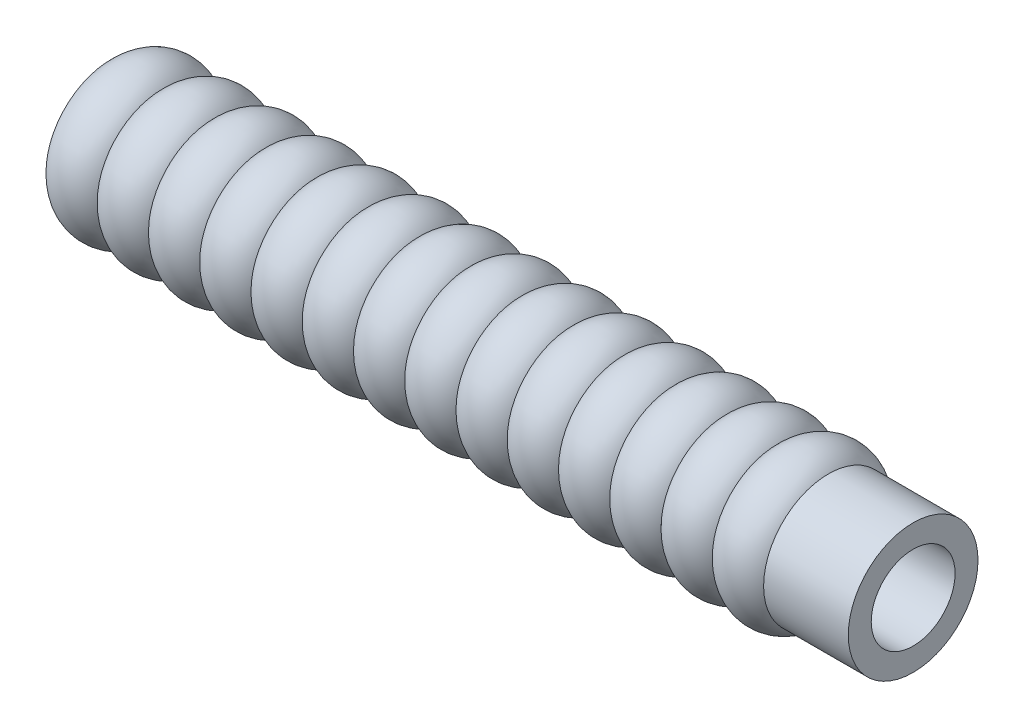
ISO-10303-21;
HEADER;
FILE_DESCRIPTION(('STEP AP214'),'2;1');
FILE_NAME('part.step','',(''),(''),'','','');
FILE_SCHEMA(('AUTOMOTIVE_DESIGN { 1 0 10303 214 1 1 1 1 }'));
ENDSEC;
DATA;
#1=APPLICATION_CONTEXT('core data for automotive mechanical design processes');
#2=APPLICATION_PROTOCOL_DEFINITION('international standard','automotive_design',2000,#1);
#3=PRODUCT_CONTEXT('',#1,'mechanical');
#4=PRODUCT('Part','Part','',(#3));
#5=PRODUCT_RELATED_PRODUCT_CATEGORY('part','',(#4));
#6=PRODUCT_DEFINITION_FORMATION('','',#4);
#7=PRODUCT_DEFINITION_CONTEXT('part definition',#1,'design');
#8=PRODUCT_DEFINITION('design','',#6,#7);
#9=PRODUCT_DEFINITION_SHAPE('','',#8);
#10=(LENGTH_UNIT() NAMED_UNIT(*) SI_UNIT(.MILLI.,.METRE.));
#11=(NAMED_UNIT(*) PLANE_ANGLE_UNIT() SI_UNIT($,.RADIAN.));
#12=(NAMED_UNIT(*) SI_UNIT($,.STERADIAN.) SOLID_ANGLE_UNIT());
#13=UNCERTAINTY_MEASURE_WITH_UNIT(LENGTH_MEASURE(1.E-05),#10,'distance_accuracy_value','');
#14=(GEOMETRIC_REPRESENTATION_CONTEXT(3) GLOBAL_UNCERTAINTY_ASSIGNED_CONTEXT((#13)) GLOBAL_UNIT_ASSIGNED_CONTEXT((#10,
#11,#12)) REPRESENTATION_CONTEXT('',''));
#15=CARTESIAN_POINT('',(0.,0.,0.));
#16=DIRECTION('',(0.,0.,1.));
#17=DIRECTION('',(1.,0.,0.));
#18=AXIS2_PLACEMENT_3D('',#15,#16,#17);
#19=CARTESIAN_POINT('',(21.0247582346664,0.,0.));
#20=DIRECTION('',(-1.,0.,0.));
#21=DIRECTION('',(0.,0.,1.));
#22=AXIS2_PLACEMENT_3D('',#19,#20,#21);
#23=CYLINDRICAL_SURFACE('',#22,3.65813100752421);
#24=CARTESIAN_POINT('',(112.609903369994,0.,0.));
#25=DIRECTION('',(-1.,0.,0.));
#26=DIRECTION('',(0.,0.,1.));
#27=AXIS2_PLACEMENT_3D('',#24,#25,#26);
#28=CIRCLE('',#27,3.65813100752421);
#29=CARTESIAN_POINT('',(112.609903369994,0.,3.65813100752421));
#30=VERTEX_POINT('',#29);
#31=EDGE_CURVE('E122',#30,#30,#28,.T.);
#32=ORIENTED_EDGE('',*,*,#31,.T.);
#33=EDGE_LOOP('',(#32));
#34=FACE_BOUND('',#33,.T.);
#35=CARTESIAN_POINT('',(120.,0.,0.));
#36=DIRECTION('',(1.,0.,0.));
#37=DIRECTION('',(0.,0.,-1.));
#38=AXIS2_PLACEMENT_3D('',#35,#36,#37);
#39=CIRCLE('',#38,3.65813100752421);
#40=CARTESIAN_POINT('',(120.,0.,-3.65813100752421));
#41=VERTEX_POINT('',#40);
#42=EDGE_CURVE('E11',#41,#41,#39,.F.);
#43=ORIENTED_EDGE('',*,*,#42,.F.);
#44=EDGE_LOOP('',(#43));
#45=FACE_BOUND('',#44,.T.);
#46=ADVANCED_FACE('F42',(#34,#45),#23,.F.);
#47=CARTESIAN_POINT('',(21.0247582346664,0.,0.));
#48=DIRECTION('',(-1.,0.,0.));
#49=DIRECTION('',(0.,0.,1.));
#50=AXIS2_PLACEMENT_3D('',#47,#48,#49);
#51=CYLINDRICAL_SURFACE('',#50,5.65813100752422);
#52=CARTESIAN_POINT('',(112.609903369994,0.,0.));
#53=DIRECTION('',(-1.,0.,0.));
#54=DIRECTION('',(0.,0.,1.));
#55=AXIS2_PLACEMENT_3D('',#52,#53,#54);
#56=CIRCLE('',#55,5.65813100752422);
#57=CARTESIAN_POINT('',(112.609903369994,0.,5.65813100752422));
#58=VERTEX_POINT('',#57);
#59=EDGE_CURVE('E118',#58,#58,#56,.T.);
#60=ORIENTED_EDGE('',*,*,#59,.F.);
#61=EDGE_LOOP('',(#60));
#62=FACE_BOUND('',#61,.T.);
#63=CARTESIAN_POINT('',(120.,0.,0.));
#64=DIRECTION('',(1.,0.,0.));
#65=DIRECTION('',(0.,0.,-1.));
#66=AXIS2_PLACEMENT_3D('',#63,#64,#65);
#67=CIRCLE('',#66,5.65813100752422);
#68=CARTESIAN_POINT('',(120.,0.,-5.65813100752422));
#69=VERTEX_POINT('',#68);
#70=EDGE_CURVE('E46',#69,#69,#67,.T.);
#71=ORIENTED_EDGE('',*,*,#70,.F.);
#72=EDGE_LOOP('',(#71));
#73=FACE_BOUND('',#72,.T.);
#74=ADVANCED_FACE('F181',(#62,#73),#51,.T.);
#75=CARTESIAN_POINT('',(52.2360679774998,0.,0.));
#76=DIRECTION('',(-1.,0.,0.));
#77=DIRECTION('',(0.,0.,1.));
#78=AXIS2_PLACEMENT_3D('',#75,#76,#77);
#79=TOROIDAL_SURFACE('',#78,5.65813100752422,3.);
#80=CARTESIAN_POINT('',(54.4721359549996,0.,0.));
#81=DIRECTION('',(-1.,0.,0.));
#82=DIRECTION('',(0.,0.,1.));
#83=AXIS2_PLACEMENT_3D('',#80,#81,#82);
#84=CIRCLE('',#83,3.65813100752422);
#85=CARTESIAN_POINT('',(54.4721359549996,0.,3.65813100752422));
#86=VERTEX_POINT('',#85);
#87=EDGE_CURVE('E56',#86,#86,#84,.T.);
#88=ORIENTED_EDGE('',*,*,#87,.F.);
#89=EDGE_LOOP('',(#88));
#90=FACE_BOUND('',#89,.T.);
#91=CARTESIAN_POINT('',(50.,0.,0.));
#92=DIRECTION('',(-1.,0.,0.));
#93=DIRECTION('',(0.,0.,1.));
#94=AXIS2_PLACEMENT_3D('',#91,#92,#93);
#95=CIRCLE('',#94,3.65813100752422);
#96=CARTESIAN_POINT('',(50.,0.,3.65813100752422));
#97=VERTEX_POINT('',#96);
#98=EDGE_CURVE('E58',#97,#97,#95,.T.);
#99=ORIENTED_EDGE('',*,*,#98,.T.);
#100=EDGE_LOOP('',(#99));
#101=FACE_BOUND('',#100,.T.);
#102=ADVANCED_FACE('F44',(#90,#101),#79,.T.);
#103=CARTESIAN_POINT('',(56.7082039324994,0.,0.));
#104=DIRECTION('',(-1.,0.,0.));
#105=DIRECTION('',(0.,0.,1.));
#106=AXIS2_PLACEMENT_3D('',#103,#104,#105);
#107=TOROIDAL_SURFACE('',#106,5.65813100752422,3.);
#108=CARTESIAN_POINT('',(58.9442719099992,0.,0.));
#109=DIRECTION('',(-1.,0.,0.));
#110=DIRECTION('',(0.,0.,1.));
#111=AXIS2_PLACEMENT_3D('',#108,#109,#110);
#112=CIRCLE('',#111,3.65813100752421);
#113=CARTESIAN_POINT('',(58.9442719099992,0.,3.65813100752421));
#114=VERTEX_POINT('',#113);
#115=EDGE_CURVE('E170',#114,#114,#112,.T.);
#116=ORIENTED_EDGE('',*,*,#115,.F.);
#117=EDGE_LOOP('',(#116));
#118=FACE_BOUND('',#117,.T.);
#119=ORIENTED_EDGE('',*,*,#87,.T.);
#120=EDGE_LOOP('',(#119));
#121=FACE_BOUND('',#120,.T.);
#122=ADVANCED_FACE('F177',(#118,#121),#107,.T.);
#123=CARTESIAN_POINT('',(61.180339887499,0.,0.));
#124=DIRECTION('',(-1.,0.,0.));
#125=DIRECTION('',(0.,0.,1.));
#126=AXIS2_PLACEMENT_3D('',#123,#124,#125);
#127=TOROIDAL_SURFACE('',#126,5.65813100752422,3.);
#128=CARTESIAN_POINT('',(63.4164078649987,0.,0.));
#129=DIRECTION('',(-1.,0.,0.));
#130=DIRECTION('',(0.,0.,1.));
#131=AXIS2_PLACEMENT_3D('',#128,#129,#130);
#132=CIRCLE('',#131,3.65813100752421);
#133=CARTESIAN_POINT('',(63.4164078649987,0.,3.65813100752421));
#134=VERTEX_POINT('',#133);
#135=EDGE_CURVE('E166',#134,#134,#132,.T.);
#136=ORIENTED_EDGE('',*,*,#135,.F.);
#137=EDGE_LOOP('',(#136));
#138=FACE_BOUND('',#137,.T.);
#139=ORIENTED_EDGE('',*,*,#115,.T.);
#140=EDGE_LOOP('',(#139));
#141=FACE_BOUND('',#140,.T.);
#142=ADVANCED_FACE('F255',(#138,#141),#127,.T.);
#143=CARTESIAN_POINT('',(65.6524758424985,0.,0.));
#144=DIRECTION('',(-1.,0.,0.));
#145=DIRECTION('',(0.,0.,1.));
#146=AXIS2_PLACEMENT_3D('',#143,#144,#145);
#147=TOROIDAL_SURFACE('',#146,5.65813100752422,3.);
#148=CARTESIAN_POINT('',(67.8885438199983,0.,0.));
#149=DIRECTION('',(-1.,0.,0.));
#150=DIRECTION('',(0.,0.,1.));
#151=AXIS2_PLACEMENT_3D('',#148,#149,#150);
#152=CIRCLE('',#151,3.65813100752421);
#153=CARTESIAN_POINT('',(67.8885438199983,0.,3.65813100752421));
#154=VERTEX_POINT('',#153);
#155=EDGE_CURVE('E162',#154,#154,#152,.T.);
#156=ORIENTED_EDGE('',*,*,#155,.F.);
#157=EDGE_LOOP('',(#156));
#158=FACE_BOUND('',#157,.T.);
#159=ORIENTED_EDGE('',*,*,#135,.T.);
#160=EDGE_LOOP('',(#159));
#161=FACE_BOUND('',#160,.T.);
#162=ADVANCED_FACE('F251',(#158,#161),#147,.T.);
#163=CARTESIAN_POINT('',(70.1246117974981,0.,0.));
#164=DIRECTION('',(-1.,0.,0.));
#165=DIRECTION('',(0.,0.,1.));
#166=AXIS2_PLACEMENT_3D('',#163,#164,#165);
#167=TOROIDAL_SURFACE('',#166,5.65813100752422,3.);
#168=CARTESIAN_POINT('',(72.3606797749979,0.,0.));
#169=DIRECTION('',(-1.,0.,0.));
#170=DIRECTION('',(0.,0.,1.));
#171=AXIS2_PLACEMENT_3D('',#168,#169,#170);
#172=CIRCLE('',#171,3.65813100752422);
#173=CARTESIAN_POINT('',(72.3606797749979,0.,3.65813100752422));
#174=VERTEX_POINT('',#173);
#175=EDGE_CURVE('E158',#174,#174,#172,.T.);
#176=ORIENTED_EDGE('',*,*,#175,.F.);
#177=EDGE_LOOP('',(#176));
#178=FACE_BOUND('',#177,.T.);
#179=ORIENTED_EDGE('',*,*,#155,.T.);
#180=EDGE_LOOP('',(#179));
#181=FACE_BOUND('',#180,.T.);
#182=ADVANCED_FACE('F247',(#178,#181),#167,.T.);
#183=CARTESIAN_POINT('',(74.5967477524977,0.,0.));
#184=DIRECTION('',(-1.,0.,0.));
#185=DIRECTION('',(0.,0.,1.));
#186=AXIS2_PLACEMENT_3D('',#183,#184,#185);
#187=TOROIDAL_SURFACE('',#186,5.65813100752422,3.);
#188=CARTESIAN_POINT('',(76.8328157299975,0.,0.));
#189=DIRECTION('',(-1.,0.,0.));
#190=DIRECTION('',(0.,0.,1.));
#191=AXIS2_PLACEMENT_3D('',#188,#189,#190);
#192=CIRCLE('',#191,3.65813100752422);
#193=CARTESIAN_POINT('',(76.8328157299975,0.,3.65813100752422));
#194=VERTEX_POINT('',#193);
#195=EDGE_CURVE('E154',#194,#194,#192,.T.);
#196=ORIENTED_EDGE('',*,*,#195,.F.);
#197=EDGE_LOOP('',(#196));
#198=FACE_BOUND('',#197,.T.);
#199=ORIENTED_EDGE('',*,*,#175,.T.);
#200=EDGE_LOOP('',(#199));
#201=FACE_BOUND('',#200,.T.);
#202=ADVANCED_FACE('F243',(#198,#201),#187,.T.);
#203=CARTESIAN_POINT('',(79.0688837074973,0.,0.));
#204=DIRECTION('',(-1.,0.,0.));
#205=DIRECTION('',(0.,0.,1.));
#206=AXIS2_PLACEMENT_3D('',#203,#204,#205);
#207=TOROIDAL_SURFACE('',#206,5.65813100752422,3.);
#208=CARTESIAN_POINT('',(81.3049516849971,0.,0.));
#209=DIRECTION('',(-1.,0.,0.));
#210=DIRECTION('',(0.,0.,1.));
#211=AXIS2_PLACEMENT_3D('',#208,#209,#210);
#212=CIRCLE('',#211,3.65813100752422);
#213=CARTESIAN_POINT('',(81.3049516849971,0.,3.65813100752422));
#214=VERTEX_POINT('',#213);
#215=EDGE_CURVE('E150',#214,#214,#212,.T.);
#216=ORIENTED_EDGE('',*,*,#215,.F.);
#217=EDGE_LOOP('',(#216));
#218=FACE_BOUND('',#217,.T.);
#219=ORIENTED_EDGE('',*,*,#195,.T.);
#220=EDGE_LOOP('',(#219));
#221=FACE_BOUND('',#220,.T.);
#222=ADVANCED_FACE('F239',(#218,#221),#207,.T.);
#223=CARTESIAN_POINT('',(83.5410196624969,0.,0.));
#224=DIRECTION('',(-1.,0.,0.));
#225=DIRECTION('',(0.,0.,1.));
#226=AXIS2_PLACEMENT_3D('',#223,#224,#225);
#227=TOROIDAL_SURFACE('',#226,5.65813100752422,3.);
#228=CARTESIAN_POINT('',(85.7770876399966,0.,0.));
#229=DIRECTION('',(-1.,0.,0.));
#230=DIRECTION('',(0.,0.,1.));
#231=AXIS2_PLACEMENT_3D('',#228,#229,#230);
#232=CIRCLE('',#231,3.65813100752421);
#233=CARTESIAN_POINT('',(85.7770876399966,0.,3.65813100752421));
#234=VERTEX_POINT('',#233);
#235=EDGE_CURVE('E146',#234,#234,#232,.T.);
#236=ORIENTED_EDGE('',*,*,#235,.F.);
#237=EDGE_LOOP('',(#236));
#238=FACE_BOUND('',#237,.T.);
#239=ORIENTED_EDGE('',*,*,#215,.T.);
#240=EDGE_LOOP('',(#239));
#241=FACE_BOUND('',#240,.T.);
#242=ADVANCED_FACE('F235',(#238,#241),#227,.T.);
#243=CARTESIAN_POINT('',(88.0131556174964,0.,0.));
#244=DIRECTION('',(-1.,0.,0.));
#245=DIRECTION('',(0.,0.,1.));
#246=AXIS2_PLACEMENT_3D('',#243,#244,#245);
#247=TOROIDAL_SURFACE('',#246,5.65813100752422,3.);
#248=CARTESIAN_POINT('',(90.2492235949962,0.,0.));
#249=DIRECTION('',(-1.,0.,0.));
#250=DIRECTION('',(0.,0.,1.));
#251=AXIS2_PLACEMENT_3D('',#248,#249,#250);
#252=CIRCLE('',#251,3.65813100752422);
#253=CARTESIAN_POINT('',(90.2492235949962,0.,3.65813100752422));
#254=VERTEX_POINT('',#253);
#255=EDGE_CURVE('E142',#254,#254,#252,.T.);
#256=ORIENTED_EDGE('',*,*,#255,.F.);
#257=EDGE_LOOP('',(#256));
#258=FACE_BOUND('',#257,.T.);
#259=ORIENTED_EDGE('',*,*,#235,.T.);
#260=EDGE_LOOP('',(#259));
#261=FACE_BOUND('',#260,.T.);
#262=ADVANCED_FACE('F231',(#258,#261),#247,.T.);
#263=CARTESIAN_POINT('',(92.485291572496,0.,0.));
#264=DIRECTION('',(-1.,0.,0.));
#265=DIRECTION('',(0.,0.,1.));
#266=AXIS2_PLACEMENT_3D('',#263,#264,#265);
#267=TOROIDAL_SURFACE('',#266,5.65813100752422,3.);
#268=CARTESIAN_POINT('',(94.7213595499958,0.,0.));
#269=DIRECTION('',(-1.,0.,0.));
#270=DIRECTION('',(0.,0.,1.));
#271=AXIS2_PLACEMENT_3D('',#268,#269,#270);
#272=CIRCLE('',#271,3.65813100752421);
#273=CARTESIAN_POINT('',(94.7213595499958,0.,3.65813100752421));
#274=VERTEX_POINT('',#273);
#275=EDGE_CURVE('E138',#274,#274,#272,.T.);
#276=ORIENTED_EDGE('',*,*,#275,.F.);
#277=EDGE_LOOP('',(#276));
#278=FACE_BOUND('',#277,.T.);
#279=ORIENTED_EDGE('',*,*,#255,.T.);
#280=EDGE_LOOP('',(#279));
#281=FACE_BOUND('',#280,.T.);
#282=ADVANCED_FACE('F227',(#278,#281),#267,.T.);
#283=CARTESIAN_POINT('',(96.9574275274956,0.,0.));
#284=DIRECTION('',(-1.,0.,0.));
#285=DIRECTION('',(0.,0.,1.));
#286=AXIS2_PLACEMENT_3D('',#283,#284,#285);
#287=TOROIDAL_SURFACE('',#286,5.65813100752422,3.);
#288=CARTESIAN_POINT('',(99.1934955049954,0.,0.));
#289=DIRECTION('',(-1.,0.,0.));
#290=DIRECTION('',(0.,0.,1.));
#291=AXIS2_PLACEMENT_3D('',#288,#289,#290);
#292=CIRCLE('',#291,3.65813100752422);
#293=CARTESIAN_POINT('',(99.1934955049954,0.,3.65813100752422));
#294=VERTEX_POINT('',#293);
#295=EDGE_CURVE('E134',#294,#294,#292,.T.);
#296=ORIENTED_EDGE('',*,*,#295,.F.);
#297=EDGE_LOOP('',(#296));
#298=FACE_BOUND('',#297,.T.);
#299=ORIENTED_EDGE('',*,*,#275,.T.);
#300=EDGE_LOOP('',(#299));
#301=FACE_BOUND('',#300,.T.);
#302=ADVANCED_FACE('F223',(#298,#301),#287,.T.);
#303=CARTESIAN_POINT('',(101.429563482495,0.,0.));
#304=DIRECTION('',(-1.,0.,0.));
#305=DIRECTION('',(0.,0.,1.));
#306=AXIS2_PLACEMENT_3D('',#303,#304,#305);
#307=TOROIDAL_SURFACE('',#306,5.65813100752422,2.99999999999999);
#308=CARTESIAN_POINT('',(103.665631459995,0.,0.));
#309=DIRECTION('',(-1.,0.,0.));
#310=DIRECTION('',(0.,0.,1.));
#311=AXIS2_PLACEMENT_3D('',#308,#309,#310);
#312=CIRCLE('',#311,3.65813100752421);
#313=CARTESIAN_POINT('',(103.665631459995,0.,3.65813100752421));
#314=VERTEX_POINT('',#313);
#315=EDGE_CURVE('E130',#314,#314,#312,.T.);
#316=ORIENTED_EDGE('',*,*,#315,.F.);
#317=EDGE_LOOP('',(#316));
#318=FACE_BOUND('',#317,.T.);
#319=ORIENTED_EDGE('',*,*,#295,.T.);
#320=EDGE_LOOP('',(#319));
#321=FACE_BOUND('',#320,.T.);
#322=ADVANCED_FACE('F219',(#318,#321),#307,.T.);
#323=CARTESIAN_POINT('',(105.901699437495,0.,0.));
#324=DIRECTION('',(-1.,0.,0.));
#325=DIRECTION('',(0.,0.,1.));
#326=AXIS2_PLACEMENT_3D('',#323,#324,#325);
#327=TOROIDAL_SURFACE('',#326,5.65813100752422,3.);
#328=CARTESIAN_POINT('',(108.137767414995,0.,0.));
#329=DIRECTION('',(-1.,0.,0.));
#330=DIRECTION('',(0.,0.,1.));
#331=AXIS2_PLACEMENT_3D('',#328,#329,#330);
#332=CIRCLE('',#331,3.65813100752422);
#333=CARTESIAN_POINT('',(108.137767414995,0.,3.65813100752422));
#334=VERTEX_POINT('',#333);
#335=EDGE_CURVE('E126',#334,#334,#332,.T.);
#336=ORIENTED_EDGE('',*,*,#335,.F.);
#337=EDGE_LOOP('',(#336));
#338=FACE_BOUND('',#337,.T.);
#339=ORIENTED_EDGE('',*,*,#315,.T.);
#340=EDGE_LOOP('',(#339));
#341=FACE_BOUND('',#340,.T.);
#342=ADVANCED_FACE('F215',(#338,#341),#327,.T.);
#343=CARTESIAN_POINT('',(110.373835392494,0.,0.));
#344=DIRECTION('',(-1.,0.,0.));
#345=DIRECTION('',(0.,0.,1.));
#346=AXIS2_PLACEMENT_3D('',#343,#344,#345);
#347=TOROIDAL_SURFACE('',#346,5.65813100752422,3.);
#348=ORIENTED_EDGE('',*,*,#31,.F.);
#349=EDGE_LOOP('',(#348));
#350=FACE_BOUND('',#349,.T.);
#351=ORIENTED_EDGE('',*,*,#335,.T.);
#352=EDGE_LOOP('',(#351));
#353=FACE_BOUND('',#352,.T.);
#354=ADVANCED_FACE('F211',(#350,#353),#347,.T.);
#355=CARTESIAN_POINT('',(110.373835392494,0.,0.));
#356=DIRECTION('',(-1.,0.,0.));
#357=DIRECTION('',(0.,0.,1.));
#358=AXIS2_PLACEMENT_3D('',#355,#356,#357);
#359=TOROIDAL_SURFACE('',#358,3.65813100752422,3.);
#360=CARTESIAN_POINT('',(108.137767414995,0.,0.));
#361=DIRECTION('',(-1.,0.,0.));
#362=DIRECTION('',(0.,0.,1.));
#363=AXIS2_PLACEMENT_3D('',#360,#361,#362);
#364=CIRCLE('',#363,5.65813100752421);
#365=CARTESIAN_POINT('',(108.137767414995,0.,5.65813100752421));
#366=VERTEX_POINT('',#365);
#367=EDGE_CURVE('E114',#366,#366,#364,.T.);
#368=ORIENTED_EDGE('',*,*,#367,.F.);
#369=EDGE_LOOP('',(#368));
#370=FACE_BOUND('',#369,.T.);
#371=ORIENTED_EDGE('',*,*,#59,.T.);
#372=EDGE_LOOP('',(#371));
#373=FACE_BOUND('',#372,.T.);
#374=ADVANCED_FACE('F214',(#370,#373),#359,.T.);
#375=CARTESIAN_POINT('',(105.901699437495,0.,0.));
#376=DIRECTION('',(-1.,0.,0.));
#377=DIRECTION('',(0.,0.,1.));
#378=AXIS2_PLACEMENT_3D('',#375,#376,#377);
#379=TOROIDAL_SURFACE('',#378,3.65813100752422,3.);
#380=CARTESIAN_POINT('',(103.665631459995,0.,0.));
#381=DIRECTION('',(-1.,0.,0.));
#382=DIRECTION('',(0.,0.,1.));
#383=AXIS2_PLACEMENT_3D('',#380,#381,#382);
#384=CIRCLE('',#383,5.65813100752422);
#385=CARTESIAN_POINT('',(103.665631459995,0.,5.65813100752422));
#386=VERTEX_POINT('',#385);
#387=EDGE_CURVE('E110',#386,#386,#384,.T.);
#388=ORIENTED_EDGE('',*,*,#387,.F.);
#389=EDGE_LOOP('',(#388));
#390=FACE_BOUND('',#389,.T.);
#391=ORIENTED_EDGE('',*,*,#367,.T.);
#392=EDGE_LOOP('',(#391));
#393=FACE_BOUND('',#392,.T.);
#394=ADVANCED_FACE('F321',(#390,#393),#379,.T.);
#395=CARTESIAN_POINT('',(101.429563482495,0.,0.));
#396=DIRECTION('',(-1.,0.,0.));
#397=DIRECTION('',(0.,0.,1.));
#398=AXIS2_PLACEMENT_3D('',#395,#396,#397);
#399=TOROIDAL_SURFACE('',#398,3.65813100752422,3.00000000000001);
#400=CARTESIAN_POINT('',(99.1934955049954,0.,0.));
#401=DIRECTION('',(-1.,0.,0.));
#402=DIRECTION('',(0.,0.,1.));
#403=AXIS2_PLACEMENT_3D('',#400,#401,#402);
#404=CIRCLE('',#403,5.65813100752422);
#405=CARTESIAN_POINT('',(99.1934955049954,0.,5.65813100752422));
#406=VERTEX_POINT('',#405);
#407=EDGE_CURVE('E106',#406,#406,#404,.T.);
#408=ORIENTED_EDGE('',*,*,#407,.F.);
#409=EDGE_LOOP('',(#408));
#410=FACE_BOUND('',#409,.T.);
#411=ORIENTED_EDGE('',*,*,#387,.T.);
#412=EDGE_LOOP('',(#411));
#413=FACE_BOUND('',#412,.T.);
#414=ADVANCED_FACE('F328',(#410,#413),#399,.T.);
#415=CARTESIAN_POINT('',(96.9574275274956,0.,0.));
#416=DIRECTION('',(-1.,0.,0.));
#417=DIRECTION('',(0.,0.,1.));
#418=AXIS2_PLACEMENT_3D('',#415,#416,#417);
#419=TOROIDAL_SURFACE('',#418,3.65813100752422,3.);
#420=CARTESIAN_POINT('',(94.7213595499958,0.,0.));
#421=DIRECTION('',(-1.,0.,0.));
#422=DIRECTION('',(0.,0.,1.));
#423=AXIS2_PLACEMENT_3D('',#420,#421,#422);
#424=CIRCLE('',#423,5.65813100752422);
#425=CARTESIAN_POINT('',(94.7213595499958,0.,5.65813100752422));
#426=VERTEX_POINT('',#425);
#427=EDGE_CURVE('E102',#426,#426,#424,.T.);
#428=ORIENTED_EDGE('',*,*,#427,.F.);
#429=EDGE_LOOP('',(#428));
#430=FACE_BOUND('',#429,.T.);
#431=ORIENTED_EDGE('',*,*,#407,.T.);
#432=EDGE_LOOP('',(#431));
#433=FACE_BOUND('',#432,.T.);
#434=ADVANCED_FACE('F336',(#430,#433),#419,.T.);
#435=CARTESIAN_POINT('',(92.485291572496,0.,0.));
#436=DIRECTION('',(-1.,0.,0.));
#437=DIRECTION('',(0.,0.,1.));
#438=AXIS2_PLACEMENT_3D('',#435,#436,#437);
#439=TOROIDAL_SURFACE('',#438,3.65813100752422,3.00000000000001);
#440=CARTESIAN_POINT('',(90.2492235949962,0.,0.));
#441=DIRECTION('',(-1.,0.,0.));
#442=DIRECTION('',(0.,0.,1.));
#443=AXIS2_PLACEMENT_3D('',#440,#441,#442);
#444=CIRCLE('',#443,5.65813100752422);
#445=CARTESIAN_POINT('',(90.2492235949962,0.,5.65813100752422));
#446=VERTEX_POINT('',#445);
#447=EDGE_CURVE('E98',#446,#446,#444,.T.);
#448=ORIENTED_EDGE('',*,*,#447,.F.);
#449=EDGE_LOOP('',(#448));
#450=FACE_BOUND('',#449,.T.);
#451=ORIENTED_EDGE('',*,*,#427,.T.);
#452=EDGE_LOOP('',(#451));
#453=FACE_BOUND('',#452,.T.);
#454=ADVANCED_FACE('F344',(#450,#453),#439,.T.);
#455=CARTESIAN_POINT('',(88.0131556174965,0.,0.));
#456=DIRECTION('',(-1.,0.,0.));
#457=DIRECTION('',(0.,0.,1.));
#458=AXIS2_PLACEMENT_3D('',#455,#456,#457);
#459=TOROIDAL_SURFACE('',#458,3.65813100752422,3.);
#460=CARTESIAN_POINT('',(85.7770876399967,0.,0.));
#461=DIRECTION('',(-1.,0.,0.));
#462=DIRECTION('',(0.,0.,1.));
#463=AXIS2_PLACEMENT_3D('',#460,#461,#462);
#464=CIRCLE('',#463,5.65813100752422);
#465=CARTESIAN_POINT('',(85.7770876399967,0.,5.65813100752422));
#466=VERTEX_POINT('',#465);
#467=EDGE_CURVE('E94',#466,#466,#464,.T.);
#468=ORIENTED_EDGE('',*,*,#467,.F.);
#469=EDGE_LOOP('',(#468));
#470=FACE_BOUND('',#469,.T.);
#471=ORIENTED_EDGE('',*,*,#447,.T.);
#472=EDGE_LOOP('',(#471));
#473=FACE_BOUND('',#472,.T.);
#474=ADVANCED_FACE('F352',(#470,#473),#459,.T.);
#475=CARTESIAN_POINT('',(83.5410196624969,0.,0.));
#476=DIRECTION('',(-1.,0.,0.));
#477=DIRECTION('',(0.,0.,1.));
#478=AXIS2_PLACEMENT_3D('',#475,#476,#477);
#479=TOROIDAL_SURFACE('',#478,3.65813100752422,3.00000000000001);
#480=CARTESIAN_POINT('',(81.3049516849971,0.,0.));
#481=DIRECTION('',(-1.,0.,0.));
#482=DIRECTION('',(0.,0.,1.));
#483=AXIS2_PLACEMENT_3D('',#480,#481,#482);
#484=CIRCLE('',#483,5.65813100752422);
#485=CARTESIAN_POINT('',(81.3049516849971,0.,5.65813100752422));
#486=VERTEX_POINT('',#485);
#487=EDGE_CURVE('E90',#486,#486,#484,.T.);
#488=ORIENTED_EDGE('',*,*,#487,.F.);
#489=EDGE_LOOP('',(#488));
#490=FACE_BOUND('',#489,.T.);
#491=ORIENTED_EDGE('',*,*,#467,.T.);
#492=EDGE_LOOP('',(#491));
#493=FACE_BOUND('',#492,.T.);
#494=ADVANCED_FACE('F360',(#490,#493),#479,.T.);
#495=CARTESIAN_POINT('',(79.0688837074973,0.,0.));
#496=DIRECTION('',(-1.,0.,0.));
#497=DIRECTION('',(0.,0.,1.));
#498=AXIS2_PLACEMENT_3D('',#495,#496,#497);
#499=TOROIDAL_SURFACE('',#498,3.65813100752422,3.);
#500=CARTESIAN_POINT('',(76.8328157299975,0.,0.));
#501=DIRECTION('',(-1.,0.,0.));
#502=DIRECTION('',(0.,0.,1.));
#503=AXIS2_PLACEMENT_3D('',#500,#501,#502);
#504=CIRCLE('',#503,5.65813100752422);
#505=CARTESIAN_POINT('',(76.8328157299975,0.,5.65813100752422));
#506=VERTEX_POINT('',#505);
#507=EDGE_CURVE('E86',#506,#506,#504,.T.);
#508=ORIENTED_EDGE('',*,*,#507,.F.);
#509=EDGE_LOOP('',(#508));
#510=FACE_BOUND('',#509,.T.);
#511=ORIENTED_EDGE('',*,*,#487,.T.);
#512=EDGE_LOOP('',(#511));
#513=FACE_BOUND('',#512,.T.);
#514=ADVANCED_FACE('F368',(#510,#513),#499,.T.);
#515=CARTESIAN_POINT('',(74.5967477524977,0.,0.));
#516=DIRECTION('',(-1.,0.,0.));
#517=DIRECTION('',(0.,0.,1.));
#518=AXIS2_PLACEMENT_3D('',#515,#516,#517);
#519=TOROIDAL_SURFACE('',#518,3.65813100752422,3.);
#520=CARTESIAN_POINT('',(72.3606797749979,0.,0.));
#521=DIRECTION('',(-1.,0.,0.));
#522=DIRECTION('',(0.,0.,1.));
#523=AXIS2_PLACEMENT_3D('',#520,#521,#522);
#524=CIRCLE('',#523,5.65813100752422);
#525=CARTESIAN_POINT('',(72.3606797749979,0.,5.65813100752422));
#526=VERTEX_POINT('',#525);
#527=EDGE_CURVE('E82',#526,#526,#524,.T.);
#528=ORIENTED_EDGE('',*,*,#527,.F.);
#529=EDGE_LOOP('',(#528));
#530=FACE_BOUND('',#529,.T.);
#531=ORIENTED_EDGE('',*,*,#507,.T.);
#532=EDGE_LOOP('',(#531));
#533=FACE_BOUND('',#532,.T.);
#534=ADVANCED_FACE('F376',(#530,#533),#519,.T.);
#535=CARTESIAN_POINT('',(70.1246117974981,0.,0.));
#536=DIRECTION('',(-1.,0.,0.));
#537=DIRECTION('',(0.,0.,1.));
#538=AXIS2_PLACEMENT_3D('',#535,#536,#537);
#539=TOROIDAL_SURFACE('',#538,3.65813100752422,3.);
#540=CARTESIAN_POINT('',(67.8885438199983,0.,0.));
#541=DIRECTION('',(-1.,0.,0.));
#542=DIRECTION('',(0.,0.,1.));
#543=AXIS2_PLACEMENT_3D('',#540,#541,#542);
#544=CIRCLE('',#543,5.65813100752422);
#545=CARTESIAN_POINT('',(67.8885438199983,0.,5.65813100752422));
#546=VERTEX_POINT('',#545);
#547=EDGE_CURVE('E78',#546,#546,#544,.T.);
#548=ORIENTED_EDGE('',*,*,#547,.F.);
#549=EDGE_LOOP('',(#548));
#550=FACE_BOUND('',#549,.T.);
#551=ORIENTED_EDGE('',*,*,#527,.T.);
#552=EDGE_LOOP('',(#551));
#553=FACE_BOUND('',#552,.T.);
#554=ADVANCED_FACE('F384',(#550,#553),#539,.T.);
#555=CARTESIAN_POINT('',(65.6524758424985,0.,0.));
#556=DIRECTION('',(-1.,0.,0.));
#557=DIRECTION('',(0.,0.,1.));
#558=AXIS2_PLACEMENT_3D('',#555,#556,#557);
#559=TOROIDAL_SURFACE('',#558,3.65813100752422,3.);
#560=CARTESIAN_POINT('',(63.4164078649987,0.,0.));
#561=DIRECTION('',(-1.,0.,0.));
#562=DIRECTION('',(0.,0.,1.));
#563=AXIS2_PLACEMENT_3D('',#560,#561,#562);
#564=CIRCLE('',#563,5.65813100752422);
#565=CARTESIAN_POINT('',(63.4164078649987,0.,5.65813100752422));
#566=VERTEX_POINT('',#565);
#567=EDGE_CURVE('E74',#566,#566,#564,.T.);
#568=ORIENTED_EDGE('',*,*,#567,.F.);
#569=EDGE_LOOP('',(#568));
#570=FACE_BOUND('',#569,.T.);
#571=ORIENTED_EDGE('',*,*,#547,.T.);
#572=EDGE_LOOP('',(#571));
#573=FACE_BOUND('',#572,.T.);
#574=ADVANCED_FACE('F392',(#570,#573),#559,.T.);
#575=CARTESIAN_POINT('',(61.180339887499,0.,0.));
#576=DIRECTION('',(-1.,0.,0.));
#577=DIRECTION('',(0.,0.,1.));
#578=AXIS2_PLACEMENT_3D('',#575,#576,#577);
#579=TOROIDAL_SURFACE('',#578,3.65813100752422,3.);
#580=CARTESIAN_POINT('',(58.9442719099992,0.,0.));
#581=DIRECTION('',(-1.,0.,0.));
#582=DIRECTION('',(0.,0.,1.));
#583=AXIS2_PLACEMENT_3D('',#580,#581,#582);
#584=CIRCLE('',#583,5.65813100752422);
#585=CARTESIAN_POINT('',(58.9442719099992,0.,5.65813100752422));
#586=VERTEX_POINT('',#585);
#587=EDGE_CURVE('E70',#586,#586,#584,.T.);
#588=ORIENTED_EDGE('',*,*,#587,.F.);
#589=EDGE_LOOP('',(#588));
#590=FACE_BOUND('',#589,.T.);
#591=ORIENTED_EDGE('',*,*,#567,.T.);
#592=EDGE_LOOP('',(#591));
#593=FACE_BOUND('',#592,.T.);
#594=ADVANCED_FACE('F400',(#590,#593),#579,.T.);
#595=CARTESIAN_POINT('',(56.7082039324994,0.,0.));
#596=DIRECTION('',(-1.,0.,0.));
#597=DIRECTION('',(0.,0.,1.));
#598=AXIS2_PLACEMENT_3D('',#595,#596,#597);
#599=TOROIDAL_SURFACE('',#598,3.65813100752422,3.);
#600=CARTESIAN_POINT('',(54.4721359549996,0.,0.));
#601=DIRECTION('',(-1.,0.,0.));
#602=DIRECTION('',(0.,0.,1.));
#603=AXIS2_PLACEMENT_3D('',#600,#601,#602);
#604=CIRCLE('',#603,5.65813100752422);
#605=CARTESIAN_POINT('',(54.4721359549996,0.,5.65813100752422));
#606=VERTEX_POINT('',#605);
#607=EDGE_CURVE('E66',#606,#606,#604,.T.);
#608=ORIENTED_EDGE('',*,*,#607,.F.);
#609=EDGE_LOOP('',(#608));
#610=FACE_BOUND('',#609,.T.);
#611=ORIENTED_EDGE('',*,*,#587,.T.);
#612=EDGE_LOOP('',(#611));
#613=FACE_BOUND('',#612,.T.);
#614=ADVANCED_FACE('F197',(#610,#613),#599,.T.);
#615=CARTESIAN_POINT('',(52.2360679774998,0.,0.));
#616=DIRECTION('',(-1.,0.,0.));
#617=DIRECTION('',(0.,0.,1.));
#618=AXIS2_PLACEMENT_3D('',#615,#616,#617);
#619=TOROIDAL_SURFACE('',#618,3.65813100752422,3.);
#620=CARTESIAN_POINT('',(50.,0.,0.));
#621=DIRECTION('',(-1.,0.,0.));
#622=DIRECTION('',(0.,0.,1.));
#623=AXIS2_PLACEMENT_3D('',#620,#621,#622);
#624=CIRCLE('',#623,5.65813100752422);
#625=CARTESIAN_POINT('',(50.,0.,5.65813100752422));
#626=VERTEX_POINT('',#625);
#627=EDGE_CURVE('E62',#626,#626,#624,.T.);
#628=ORIENTED_EDGE('',*,*,#627,.F.);
#629=EDGE_LOOP('',(#628));
#630=FACE_BOUND('',#629,.T.);
#631=ORIENTED_EDGE('',*,*,#607,.T.);
#632=EDGE_LOOP('',(#631));
#633=FACE_BOUND('',#632,.T.);
#634=ADVANCED_FACE('F187',(#630,#633),#619,.T.);
#635=CARTESIAN_POINT('',(50.,0.,0.));
#636=DIRECTION('',(1.,0.,0.));
#637=DIRECTION('',(0.,0.,-1.));
#638=AXIS2_PLACEMENT_3D('',#635,#636,#637);
#639=PLANE('',#638);
#640=ORIENTED_EDGE('',*,*,#627,.T.);
#641=EDGE_LOOP('',(#640));
#642=FACE_BOUND('',#641,.T.);
#643=ORIENTED_EDGE('',*,*,#98,.F.);
#644=EDGE_LOOP('',(#643));
#645=FACE_BOUND('',#644,.T.);
#646=ADVANCED_FACE('F184',(#642,#645),#639,.F.);
#647=CARTESIAN_POINT('',(120.,0.,0.));
#648=DIRECTION('',(1.,0.,0.));
#649=DIRECTION('',(0.,0.,-1.));
#650=AXIS2_PLACEMENT_3D('',#647,#648,#649);
#651=PLANE('',#650);
#652=ORIENTED_EDGE('',*,*,#70,.T.);
#653=EDGE_LOOP('',(#652));
#654=FACE_BOUND('',#653,.T.);
#655=ORIENTED_EDGE('',*,*,#42,.T.);
#656=EDGE_LOOP('',(#655));
#657=FACE_BOUND('',#656,.T.);
#658=ADVANCED_FACE('F186',(#654,#657),#651,.T.);
#659=CLOSED_SHELL('',(#46,#74,#102,#122,#142,#162,#182,#202,#222,#242,#262,#282,#302,#322,#342,
#354,#374,#394,#414,#434,#454,#474,#494,#514,#534,#554,#574,#594,#614,#634,#646,#658));
#660=MANIFOLD_SOLID_BREP('B2',#659);
#661=ADVANCED_BREP_SHAPE_REPRESENTATION('',(#18,#660),#14);
#662=SHAPE_DEFINITION_REPRESENTATION(#9,#661);
ENDSEC;
END-ISO-10303-21;
